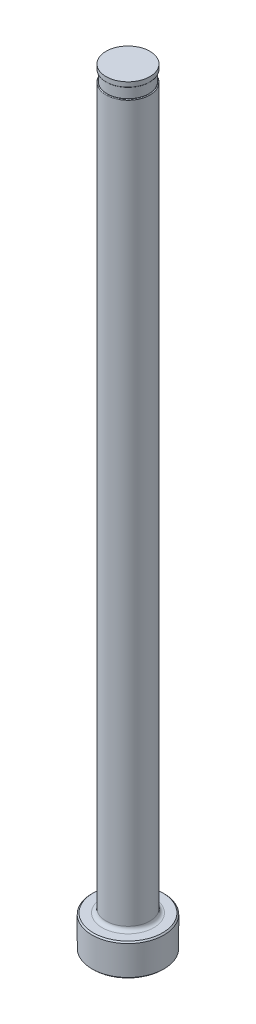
from build123d import *

# Parameters (mm, degrees)
CHAMFER1_SIZE     = 0.254
FILLET1_R         = 0.762
SKETCH2_W         = 0.2032
SKETCH2_H         = 2.032
D_SLOT_DEPTH      = 153.73390245
D_SLOT_DEPTH_BACK = 153.73390245
SKETCH5_W         = 0.00508
SKETCH5_H         = 1.016
FILLET2_R         = 0.127


with BuildPart() as part:
    # Sketch1 → Revolve1 (revolve)
    with BuildSketch(Plane.XY, mode=Mode.PRIVATE) as revolve1_sk:
        Polygon((0, 0), (-7.1374, 0), (-7.1374, 6.35), (-4.36499, 6.35), (-4.36499, 152.4), (0, 152.4), align=None)
    revolve(revolve1_sk.sketch.rotate(Axis((0, 259.958771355, 0), (0, -1, 0)), 270), axis=Axis((0, 259.958771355, 0), (0, -1, 0)))

    # Chamfer1
    chamfer1_edges = [part.edges().sort_by_distance(p)[0] for p in [
        (0, 6.35, -7.1374),
        (0, 0, -7.1374),
    ]]
    chamfer(chamfer1_edges, length=CHAMFER1_SIZE)

    # Fillet1
    fillet1_edges = [part.edges().sort_by_distance(p)[0] for p in [
        (0, 6.35, -4.36499),
    ]]
    fillet(fillet1_edges, radius=FILLET1_R)

    # Sketch2 → Vent Relief (revolve, cut)
    with BuildSketch(Plane.XY, mode=Mode.PRIVATE) as vent_relief_sk:
        with Locations((-4.26339, 150.368)):
            Rectangle(SKETCH2_W, SKETCH2_H)
    revolve(vent_relief_sk.sketch.rotate(Axis((0, 153.448281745, 0), (0, -1, 0)), 270), axis=Axis((0, 153.448281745, 0), (0, -1, 0)), mode=Mode.SUBTRACT)

    # Sketch3 → D-Slot (cut, two sides: drawn at the far end of the back side and taken through both)
    with BuildSketch(Plane.XY.offset(-D_SLOT_DEPTH_BACK)):
        with BuildLine():
            Line((-4.16179, 150.368), (-4.16179, 86.868))
            ThreePointArc((-4.16179, 86.868), (-4.213003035, 86.300038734), (-4.36499, 85.7504))
            Line((-4.36499, 85.7504), (-4.36499, 150.368))
            Line((-4.36499, 150.368), (-4.16179, 150.368))
        make_face()
    extrude(amount=D_SLOT_DEPTH + D_SLOT_DEPTH_BACK, mode=Mode.SUBTRACT)

    # Sketch5 → Vent Diameter (revolve, cut)
    with BuildSketch(Plane.XY, mode=Mode.PRIVATE) as vent_diameter_sk:
        with Locations((-4.36245, 151.892)):
            Rectangle(SKETCH5_W, SKETCH5_H)
    revolve(vent_diameter_sk.sketch.rotate(Axis((0, 152.687735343, 0), (0, -1, 0)), 90), axis=Axis((0, 152.687735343, 0), (0, -1, 0)), mode=Mode.SUBTRACT)

    # Fillet2
    fillet2_edges = [part.edges().sort_by_distance(p)[0] for p in [
        (3.521275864, 149.352, -2.579487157),
        (0, 151.384, 4.35991),
    ]]
    fillet(fillet2_edges, radius=FILLET2_R)


solid = part.part
